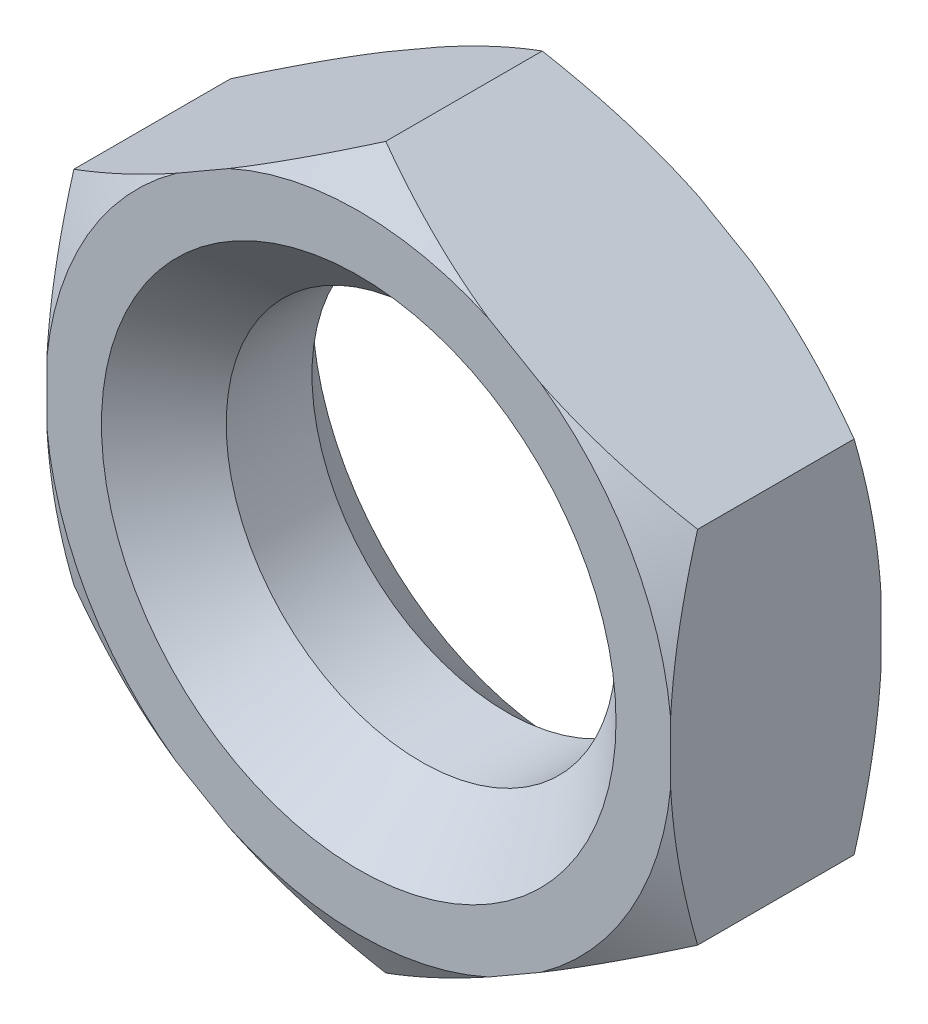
from build123d import *

# Parameters (mm, degrees)
BOSS_EXTRUDE1_DEPTH = 1.35
SKETCH6_R           = 2.5
CUT_EXTRUDE1_DEPTH  = 2.7
CHAMFER1_SIZE       = 0.8


with BuildPart() as part:
    # Sketch3 → Boss-Extrude1 (new, symmetric)
    with BuildSketch(Plane.XY):
        Polygon((0, 4.618802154), (-4, 2.309401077), (-4, -2.309401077), (0, -4.618802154), (4, -2.309401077), (4, 2.309401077), align=None)
    extrude(amount=BOSS_EXTRUDE1_DEPTH, both=True)

    # Sketch5 → Cut-Revolve1 (revolve, cut)
    with BuildSketch(Plane(origin=(0, 0, 0), x_dir=(0, 0, -1), z_dir=(1, 0, 0))):
        Polygon((-1.35, 4.618802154), (-1.35, 4.018802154), (-1.003589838, 4.618802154), align=None)
    cut_revolve1 = revolve(axis=Axis((0, 0, 5.457798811), (0, 0, -1)), mode=Mode.SUBTRACT)

    # Mirror1: Cut-Revolve1 across plane
    add(cut_revolve1.mirror(Plane.XY), mode=Mode.SUBTRACT)

    # Sketch6 → Cut-Extrude1 (cut)
    with BuildSketch(Plane.XY.offset(1.35)):
        Circle(SKETCH6_R)
    extrude(amount=-CUT_EXTRUDE1_DEPTH, mode=Mode.SUBTRACT)

    # Chamfer1
    chamfer1_edges = [part.edges().sort_by_distance(p)[0] for p in [
        (-2.5, 0, -1.35),
        (-2.5, 0, 1.35),
    ]]
    chamfer(chamfer1_edges, length=CHAMFER1_SIZE)


solid = part.part
